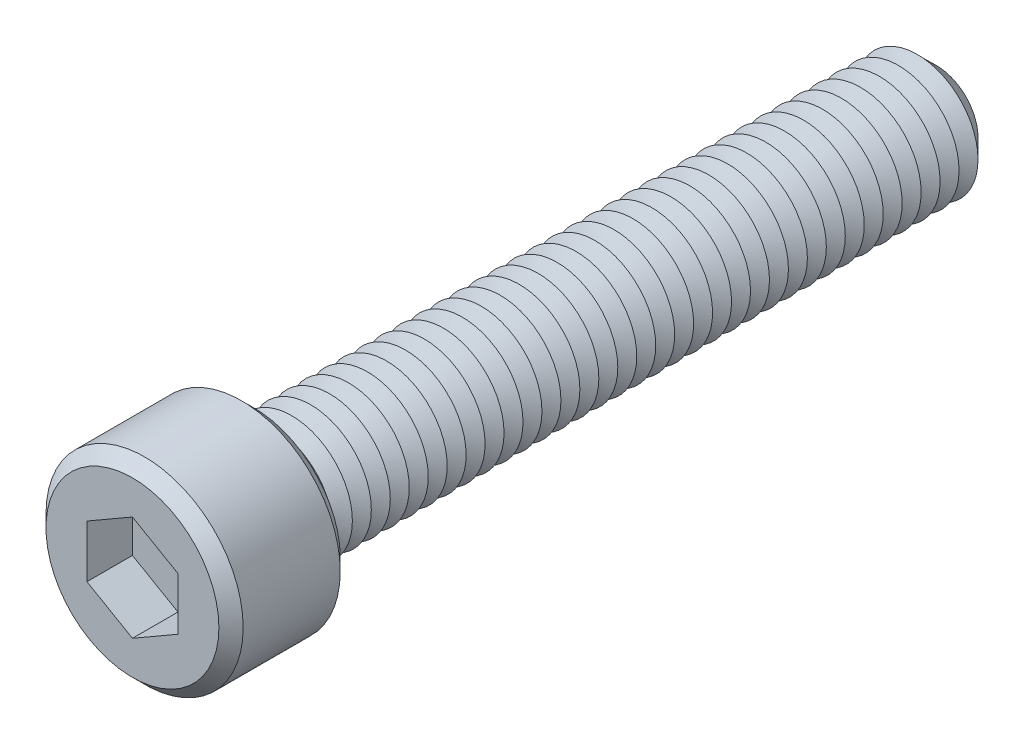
from build123d import *

# Parameters (mm, degrees)
SKETCH1_R           = 6.5
BOSS_EXTRUDE1_DEPTH = 8
SKETCH2_R           = 4
BOSS_EXTRUDE2_DEPTH = 45
CHAMFER1_SIZE       = 1.25
LPATTERN1_COUNT     = 35
LPATTERN1_PITCH     = 1.25
CUT_EXTRUDE1_DEPTH  = 3
SKETCH6_R           = 0.9
CUT_EXTRUDE2_DEPTH  = 50
CHAMFER2_SIZE       = 0.8


with BuildPart() as part:
    # Sketch1 → Boss-Extrude1 (new body)
    with BuildSketch(Plane.XY):
        Circle(SKETCH1_R)
    extrude(amount=BOSS_EXTRUDE1_DEPTH)

    # Sketch2 → Boss-Extrude2 (add)
    with BuildSketch(Plane(origin=(0, 0, 0), x_dir=(-1, 0, 0), z_dir=(0, 0, -1))):
        with Locations(Location((0, 0, 0), (0, 0, 180))):
            Circle(SKETCH2_R)
    extrude(amount=BOSS_EXTRUDE2_DEPTH)

    # Chamfer1
    chamfer1_edges = [part.edges().sort_by_distance(p)[0] for p in [
        (-4, 0, -45),
    ]]
    chamfer(chamfer1_edges, length=CHAMFER1_SIZE)

    # Sketch4 → Cut-Revolve1 (revolve, cut)
    with BuildSketch(Plane(origin=(0, 0, 0), x_dir=(0, 0, -1), z_dir=(1, 0, 0)), mode=Mode.PRIVATE) as cut_revolve1_sk:
        Polygon((0, 4), (0.625, 2.917468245), (1.25, 4), align=None)
    cut_revolve1 = revolve(cut_revolve1_sk.sketch.rotate(Axis((0, 0, 2.512122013), (0, 0, -1)), 90), axis=Axis((0, 0, 2.512122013), (0, 0, -1)), mode=Mode.SUBTRACT)

    # LPattern1: Cut-Revolve1 ×35
    with Locations(*[(0, 0, -i * LPATTERN1_PITCH) for i in range(1, LPATTERN1_COUNT)]):
        add(cut_revolve1, mode=Mode.SUBTRACT)

    # Sketch5 → Cut-Extrude1 (cut)
    with BuildSketch(Plane.XY.offset(8)):
        Polygon((0, 3.464101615), (-3, 1.732050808), (-3, -1.732050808), (0, -3.464101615), (3, -1.732050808), (3, 1.732050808), align=None)
    extrude(amount=-CUT_EXTRUDE1_DEPTH, mode=Mode.SUBTRACT)

    # Sketch6 → Cut-Extrude2 (cut)
    with BuildSketch(Plane.XY.offset(5)):
        Circle(SKETCH6_R)
    extrude(amount=-CUT_EXTRUDE2_DEPTH, mode=Mode.SUBTRACT)

    # Chamfer2
    chamfer2_edges = [part.edges().sort_by_distance(p)[0] for p in [
        (-6.5, 0, 0),
        (-6.5, 0, 8),
    ]]
    chamfer(chamfer2_edges, length=CHAMFER2_SIZE)


solid = part.part
